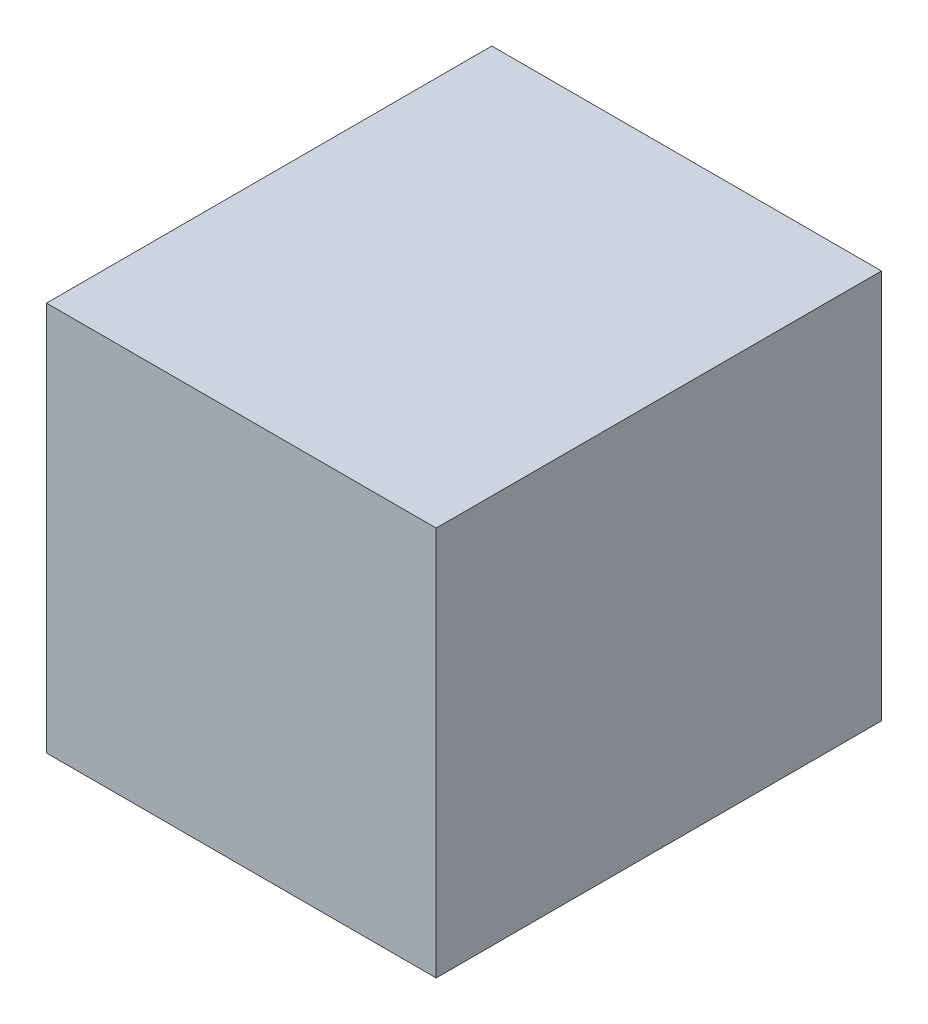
ISO-10303-21;
HEADER;
FILE_DESCRIPTION(('STEP AP214'),'2;1');
FILE_NAME('part.step','',(''),(''),'','','');
FILE_SCHEMA(('AUTOMOTIVE_DESIGN { 1 0 10303 214 1 1 1 1 }'));
ENDSEC;
DATA;
#1=APPLICATION_CONTEXT('core data for automotive mechanical design processes');
#2=APPLICATION_PROTOCOL_DEFINITION('international standard','automotive_design',2000,#1);
#3=PRODUCT_CONTEXT('',#1,'mechanical');
#4=PRODUCT('Part','Part','',(#3));
#5=PRODUCT_RELATED_PRODUCT_CATEGORY('part','',(#4));
#6=PRODUCT_DEFINITION_FORMATION('','',#4);
#7=PRODUCT_DEFINITION_CONTEXT('part definition',#1,'design');
#8=PRODUCT_DEFINITION('design','',#6,#7);
#9=PRODUCT_DEFINITION_SHAPE('','',#8);
#10=(LENGTH_UNIT() NAMED_UNIT(*) SI_UNIT(.MILLI.,.METRE.));
#11=(NAMED_UNIT(*) PLANE_ANGLE_UNIT() SI_UNIT($,.RADIAN.));
#12=(NAMED_UNIT(*) SI_UNIT($,.STERADIAN.) SOLID_ANGLE_UNIT());
#13=UNCERTAINTY_MEASURE_WITH_UNIT(LENGTH_MEASURE(1.E-05),#10,'distance_accuracy_value','');
#14=(GEOMETRIC_REPRESENTATION_CONTEXT(3) GLOBAL_UNCERTAINTY_ASSIGNED_CONTEXT((#13)) GLOBAL_UNIT_ASSIGNED_CONTEXT((#10,
#11,#12)) REPRESENTATION_CONTEXT('',''));
#15=CARTESIAN_POINT('',(0.,0.,0.));
#16=DIRECTION('',(0.,0.,1.));
#17=DIRECTION('',(1.,0.,0.));
#18=AXIS2_PLACEMENT_3D('',#15,#16,#17);
#19=CARTESIAN_POINT('',(-21.,-21.,48.));
#20=DIRECTION('',(0.,0.,1.));
#21=DIRECTION('',(1.,0.,0.));
#22=AXIS2_PLACEMENT_3D('',#19,#20,#21);
#23=PLANE('',#22);
#24=DIRECTION('',(0.,1.,0.));
#25=VECTOR('',#24,1.);
#26=CARTESIAN_POINT('',(-21.,-21.,48.));
#27=LINE('',#26,#25);
#28=CARTESIAN_POINT('',(-21.,-21.,48.));
#29=VERTEX_POINT('',#28);
#30=CARTESIAN_POINT('',(-21.,21.,48.));
#31=VERTEX_POINT('',#30);
#32=EDGE_CURVE('E87',#29,#31,#27,.T.);
#33=ORIENTED_EDGE('',*,*,#32,.F.);
#34=DIRECTION('',(1.,0.,0.));
#35=VECTOR('',#34,1.);
#36=CARTESIAN_POINT('',(-21.,-21.,48.));
#37=LINE('',#36,#35);
#38=CARTESIAN_POINT('',(21.,-21.,48.));
#39=VERTEX_POINT('',#38);
#40=EDGE_CURVE('E67',#29,#39,#37,.T.);
#41=ORIENTED_EDGE('',*,*,#40,.T.);
#42=DIRECTION('',(0.,1.,0.));
#43=VECTOR('',#42,1.);
#44=CARTESIAN_POINT('',(21.,-21.,48.));
#45=LINE('',#44,#43);
#46=CARTESIAN_POINT('',(21.,21.,48.));
#47=VERTEX_POINT('',#46);
#48=EDGE_CURVE('E81',#39,#47,#45,.T.);
#49=ORIENTED_EDGE('',*,*,#48,.T.);
#50=DIRECTION('',(1.,0.,0.));
#51=VECTOR('',#50,1.);
#52=CARTESIAN_POINT('',(-21.,21.,48.));
#53=LINE('',#52,#51);
#54=EDGE_CURVE('E10',#31,#47,#53,.T.);
#55=ORIENTED_EDGE('',*,*,#54,.F.);
#56=EDGE_LOOP('',(#33,#41,#49,#55));
#57=FACE_BOUND('',#56,.T.);
#58=ADVANCED_FACE('F16',(#57),#23,.T.);
#59=CARTESIAN_POINT('',(-21.,-21.,0.));
#60=DIRECTION('',(0.,0.,1.));
#61=DIRECTION('',(1.,0.,0.));
#62=AXIS2_PLACEMENT_3D('',#59,#60,#61);
#63=PLANE('',#62);
#64=DIRECTION('',(1.,0.,0.));
#65=VECTOR('',#64,1.);
#66=CARTESIAN_POINT('',(-21.,21.,0.));
#67=LINE('',#66,#65);
#68=CARTESIAN_POINT('',(-21.,21.,0.));
#69=VERTEX_POINT('',#68);
#70=CARTESIAN_POINT('',(21.,21.,0.));
#71=VERTEX_POINT('',#70);
#72=EDGE_CURVE('E24',#69,#71,#67,.T.);
#73=ORIENTED_EDGE('',*,*,#72,.T.);
#74=DIRECTION('',(0.,1.,0.));
#75=VECTOR('',#74,1.);
#76=CARTESIAN_POINT('',(21.,-21.,0.));
#77=LINE('',#76,#75);
#78=CARTESIAN_POINT('',(21.,-21.,0.));
#79=VERTEX_POINT('',#78);
#80=EDGE_CURVE('E103',#79,#71,#77,.T.);
#81=ORIENTED_EDGE('',*,*,#80,.F.);
#82=DIRECTION('',(1.,0.,0.));
#83=VECTOR('',#82,1.);
#84=CARTESIAN_POINT('',(-21.,-21.,0.));
#85=LINE('',#84,#83);
#86=CARTESIAN_POINT('',(-21.,-21.,0.));
#87=VERTEX_POINT('',#86);
#88=EDGE_CURVE('E79',#87,#79,#85,.T.);
#89=ORIENTED_EDGE('',*,*,#88,.F.);
#90=DIRECTION('',(0.,1.,0.));
#91=VECTOR('',#90,1.);
#92=CARTESIAN_POINT('',(-21.,-21.,0.));
#93=LINE('',#92,#91);
#94=EDGE_CURVE('E86',#87,#69,#93,.T.);
#95=ORIENTED_EDGE('',*,*,#94,.T.);
#96=EDGE_LOOP('',(#73,#81,#89,#95));
#97=FACE_BOUND('',#96,.T.);
#98=ADVANCED_FACE('F146',(#97),#63,.F.);
#99=CARTESIAN_POINT('',(-21.,21.,0.));
#100=DIRECTION('',(0.,1.,0.));
#101=DIRECTION('',(1.,0.,0.));
#102=AXIS2_PLACEMENT_3D('',#99,#100,#101);
#103=PLANE('',#102);
#104=ORIENTED_EDGE('',*,*,#72,.F.);
#105=DIRECTION('',(0.,0.,1.));
#106=VECTOR('',#105,1.);
#107=CARTESIAN_POINT('',(-21.,21.,0.));
#108=LINE('',#107,#106);
#109=EDGE_CURVE('E95',#69,#31,#108,.T.);
#110=ORIENTED_EDGE('',*,*,#109,.T.);
#111=ORIENTED_EDGE('',*,*,#54,.T.);
#112=DIRECTION('',(0.,0.,1.));
#113=VECTOR('',#112,1.);
#114=CARTESIAN_POINT('',(21.,21.,0.));
#115=LINE('',#114,#113);
#116=EDGE_CURVE('E101',#71,#47,#115,.T.);
#117=ORIENTED_EDGE('',*,*,#116,.F.);
#118=EDGE_LOOP('',(#104,#110,#111,#117));
#119=FACE_BOUND('',#118,.T.);
#120=ADVANCED_FACE('F139',(#119),#103,.T.);
#121=CARTESIAN_POINT('',(-21.,-21.,0.));
#122=DIRECTION('',(0.,1.,0.));
#123=DIRECTION('',(1.,0.,0.));
#124=AXIS2_PLACEMENT_3D('',#121,#122,#123);
#125=PLANE('',#124);
#126=DIRECTION('',(0.,0.,1.));
#127=VECTOR('',#126,1.);
#128=CARTESIAN_POINT('',(21.,-21.,0.));
#129=LINE('',#128,#127);
#130=EDGE_CURVE('E74',#79,#39,#129,.T.);
#131=ORIENTED_EDGE('',*,*,#130,.T.);
#132=ORIENTED_EDGE('',*,*,#40,.F.);
#133=DIRECTION('',(0.,0.,1.));
#134=VECTOR('',#133,1.);
#135=CARTESIAN_POINT('',(-21.,-21.,0.));
#136=LINE('',#135,#134);
#137=EDGE_CURVE('E71',#87,#29,#136,.T.);
#138=ORIENTED_EDGE('',*,*,#137,.F.);
#139=ORIENTED_EDGE('',*,*,#88,.T.);
#140=EDGE_LOOP('',(#131,#132,#138,#139));
#141=FACE_BOUND('',#140,.T.);
#142=ADVANCED_FACE('F75',(#141),#125,.F.);
#143=CARTESIAN_POINT('',(21.,-21.,0.));
#144=DIRECTION('',(1.,0.,0.));
#145=DIRECTION('',(0.,1.,0.));
#146=AXIS2_PLACEMENT_3D('',#143,#144,#145);
#147=PLANE('',#146);
#148=ORIENTED_EDGE('',*,*,#130,.F.);
#149=ORIENTED_EDGE('',*,*,#80,.T.);
#150=ORIENTED_EDGE('',*,*,#116,.T.);
#151=ORIENTED_EDGE('',*,*,#48,.F.);
#152=EDGE_LOOP('',(#148,#149,#150,#151));
#153=FACE_BOUND('',#152,.T.);
#154=ADVANCED_FACE('F123',(#153),#147,.T.);
#155=CARTESIAN_POINT('',(-21.,-21.,0.));
#156=DIRECTION('',(1.,0.,0.));
#157=DIRECTION('',(0.,1.,0.));
#158=AXIS2_PLACEMENT_3D('',#155,#156,#157);
#159=PLANE('',#158);
#160=ORIENTED_EDGE('',*,*,#32,.T.);
#161=ORIENTED_EDGE('',*,*,#109,.F.);
#162=ORIENTED_EDGE('',*,*,#94,.F.);
#163=ORIENTED_EDGE('',*,*,#137,.T.);
#164=EDGE_LOOP('',(#160,#161,#162,#163));
#165=FACE_BOUND('',#164,.T.);
#166=ADVANCED_FACE('F84',(#165),#159,.F.);
#167=CLOSED_SHELL('',(#58,#98,#120,#142,#154,#166));
#168=MANIFOLD_SOLID_BREP('B1',#167);
#169=ADVANCED_BREP_SHAPE_REPRESENTATION('',(#18,#168),#14);
#170=SHAPE_DEFINITION_REPRESENTATION(#9,#169);
ENDSEC;
END-ISO-10303-21;
